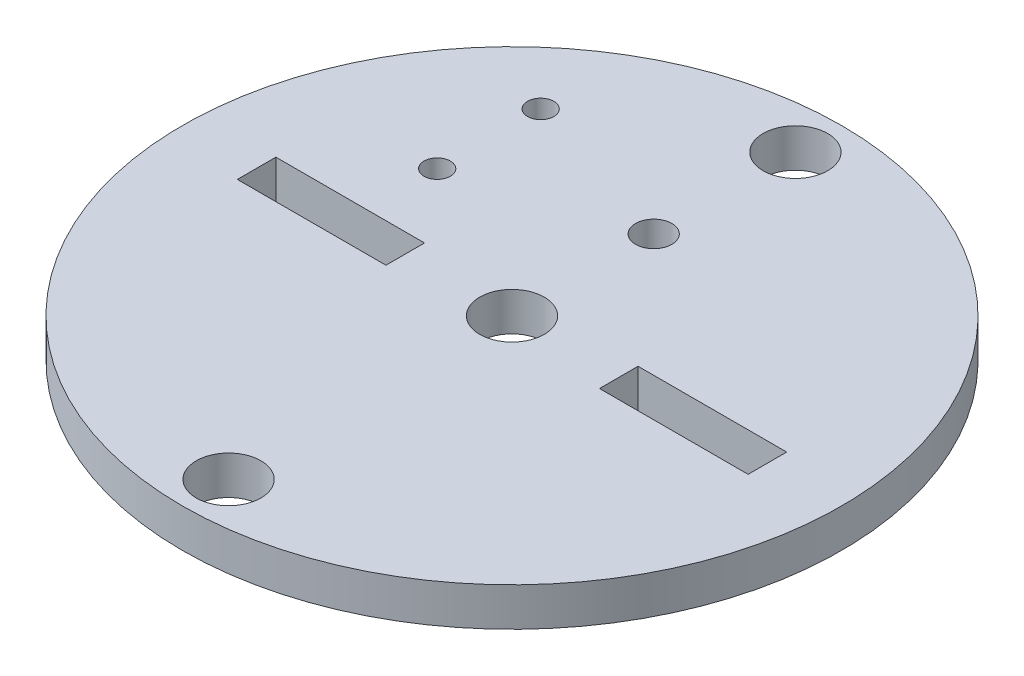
ISO-10303-21;
HEADER;
FILE_DESCRIPTION(('STEP AP214'),'2;1');
FILE_NAME('part.step','',(''),(''),'','','');
FILE_SCHEMA(('AUTOMOTIVE_DESIGN { 1 0 10303 214 1 1 1 1 }'));
ENDSEC;
DATA;
#1=APPLICATION_CONTEXT('core data for automotive mechanical design processes');
#2=APPLICATION_PROTOCOL_DEFINITION('international standard','automotive_design',2000,#1);
#3=PRODUCT_CONTEXT('',#1,'mechanical');
#4=PRODUCT('Part','Part','',(#3));
#5=PRODUCT_RELATED_PRODUCT_CATEGORY('part','',(#4));
#6=PRODUCT_DEFINITION_FORMATION('','',#4);
#7=PRODUCT_DEFINITION_CONTEXT('part definition',#1,'design');
#8=PRODUCT_DEFINITION('design','',#6,#7);
#9=PRODUCT_DEFINITION_SHAPE('','',#8);
#10=(LENGTH_UNIT() NAMED_UNIT(*) SI_UNIT(.MILLI.,.METRE.));
#11=(NAMED_UNIT(*) PLANE_ANGLE_UNIT() SI_UNIT($,.RADIAN.));
#12=(NAMED_UNIT(*) SI_UNIT($,.STERADIAN.) SOLID_ANGLE_UNIT());
#13=UNCERTAINTY_MEASURE_WITH_UNIT(LENGTH_MEASURE(1.E-05),#10,'distance_accuracy_value','');
#14=(GEOMETRIC_REPRESENTATION_CONTEXT(3) GLOBAL_UNCERTAINTY_ASSIGNED_CONTEXT((#13)) GLOBAL_UNIT_ASSIGNED_CONTEXT((#10,
#11,#12)) REPRESENTATION_CONTEXT('',''));
#15=CARTESIAN_POINT('',(0.,0.,0.));
#16=DIRECTION('',(0.,0.,1.));
#17=DIRECTION('',(1.,0.,0.));
#18=AXIS2_PLACEMENT_3D('',#15,#16,#17);
#19=CARTESIAN_POINT('',(0.,2.9718,0.));
#20=DIRECTION('',(0.,-1.,0.));
#21=DIRECTION('',(0.,0.,-1.));
#22=AXIS2_PLACEMENT_3D('',#19,#20,#21);
#23=CYLINDRICAL_SURFACE('',#22,25.4);
#24=CARTESIAN_POINT('',(0.,2.9718,0.));
#25=DIRECTION('',(0.,1.,0.));
#26=DIRECTION('',(0.,0.,1.));
#27=AXIS2_PLACEMENT_3D('',#24,#25,#26);
#28=CIRCLE('',#27,25.4);
#29=CARTESIAN_POINT('',(0.,2.9718,25.4));
#30=VERTEX_POINT('',#29);
#31=EDGE_CURVE('E11',#30,#30,#28,.T.);
#32=ORIENTED_EDGE('',*,*,#31,.F.);
#33=EDGE_LOOP('',(#32));
#34=FACE_BOUND('',#33,.T.);
#35=CARTESIAN_POINT('',(0.,0.,0.));
#36=DIRECTION('',(0.,1.,0.));
#37=DIRECTION('',(0.,0.,1.));
#38=AXIS2_PLACEMENT_3D('',#35,#36,#37);
#39=CIRCLE('',#38,25.4);
#40=CARTESIAN_POINT('',(0.,0.,25.4));
#41=VERTEX_POINT('',#40);
#42=EDGE_CURVE('E43',#41,#41,#39,.T.);
#43=ORIENTED_EDGE('',*,*,#42,.T.);
#44=EDGE_LOOP('',(#43));
#45=FACE_BOUND('',#44,.T.);
#46=ADVANCED_FACE('F40',(#34,#45),#23,.T.);
#47=CARTESIAN_POINT('',(0.,2.9718,0.));
#48=DIRECTION('',(0.,1.,0.));
#49=DIRECTION('',(0.,0.,1.));
#50=AXIS2_PLACEMENT_3D('',#47,#48,#49);
#51=PLANE('',#50);
#52=CARTESIAN_POINT('',(0.,2.9718,-10.922));
#53=DIRECTION('',(0.,1.,0.));
#54=DIRECTION('',(0.,0.,1.));
#55=AXIS2_PLACEMENT_3D('',#52,#53,#54);
#56=CIRCLE('',#55,1.397);
#57=CARTESIAN_POINT('',(0.,2.9718,-9.525));
#58=VERTEX_POINT('',#57);
#59=EDGE_CURVE('E391',#58,#58,#56,.T.);
#60=ORIENTED_EDGE('',*,*,#59,.F.);
#61=EDGE_LOOP('',(#60));
#62=FACE_BOUND('',#61,.T.);
#63=CARTESIAN_POINT('',(-12.7,2.9718,-14.9098));
#64=DIRECTION('',(0.,1.,0.));
#65=DIRECTION('',(0.,0.,1.));
#66=AXIS2_PLACEMENT_3D('',#63,#64,#65);
#67=CIRCLE('',#66,1.016);
#68=CARTESIAN_POINT('',(-12.7,2.9718,-13.8938));
#69=VERTEX_POINT('',#68);
#70=EDGE_CURVE('E396',#69,#69,#67,.T.);
#71=ORIENTED_EDGE('',*,*,#70,.F.);
#72=EDGE_LOOP('',(#71));
#73=FACE_BOUND('',#72,.T.);
#74=CARTESIAN_POINT('',(-12.7,2.9718,-6.9342));
#75=DIRECTION('',(0.,1.,0.));
#76=DIRECTION('',(0.,0.,-1.));
#77=AXIS2_PLACEMENT_3D('',#74,#75,#76);
#78=CIRCLE('',#77,1.016);
#79=CARTESIAN_POINT('',(-12.7,2.9718,-7.9502));
#80=VERTEX_POINT('',#79);
#81=EDGE_CURVE('E131',#80,#80,#78,.T.);
#82=ORIENTED_EDGE('',*,*,#81,.F.);
#83=EDGE_LOOP('',(#82));
#84=FACE_BOUND('',#83,.T.);
#85=DIRECTION('',(0.,0.,-1.));
#86=VECTOR('',#85,1.);
#87=CARTESIAN_POINT('',(19.685,2.9718,-1.4859));
#88=LINE('',#87,#86);
#89=CARTESIAN_POINT('',(19.685,2.9718,1.4859));
#90=VERTEX_POINT('',#89);
#91=CARTESIAN_POINT('',(19.685,2.9718,-1.4859));
#92=VERTEX_POINT('',#91);
#93=EDGE_CURVE('E54',#90,#92,#88,.T.);
#94=ORIENTED_EDGE('',*,*,#93,.F.);
#95=DIRECTION('',(1.,0.,0.));
#96=VECTOR('',#95,1.);
#97=CARTESIAN_POINT('',(8.2296,2.9718,1.4859));
#98=LINE('',#97,#96);
#99=CARTESIAN_POINT('',(8.2296,2.9718,1.4859));
#100=VERTEX_POINT('',#99);
#101=EDGE_CURVE('E125',#100,#90,#98,.T.);
#102=ORIENTED_EDGE('',*,*,#101,.F.);
#103=DIRECTION('',(0.,0.,1.));
#104=VECTOR('',#103,1.);
#105=CARTESIAN_POINT('',(8.2296,2.9718,-1.4859));
#106=LINE('',#105,#104);
#107=CARTESIAN_POINT('',(8.2296,2.9718,-1.4859));
#108=VERTEX_POINT('',#107);
#109=EDGE_CURVE('E128',#108,#100,#106,.T.);
#110=ORIENTED_EDGE('',*,*,#109,.F.);
#111=DIRECTION('',(-1.,0.,0.));
#112=VECTOR('',#111,1.);
#113=CARTESIAN_POINT('',(8.2296,2.9718,-1.4859));
#114=LINE('',#113,#112);
#115=EDGE_CURVE('E137',#92,#108,#114,.T.);
#116=ORIENTED_EDGE('',*,*,#115,.F.);
#117=EDGE_LOOP('',(#94,#102,#110,#116));
#118=FACE_BOUND('',#117,.T.);
#119=DIRECTION('',(0.,0.,-1.));
#120=VECTOR('',#119,1.);
#121=CARTESIAN_POINT('',(-8.2296,2.9718,-1.4859));
#122=LINE('',#121,#120);
#123=CARTESIAN_POINT('',(-8.2296,2.9718,1.4859));
#124=VERTEX_POINT('',#123);
#125=CARTESIAN_POINT('',(-8.2296,2.9718,-1.4859));
#126=VERTEX_POINT('',#125);
#127=EDGE_CURVE('E62',#124,#126,#122,.T.);
#128=ORIENTED_EDGE('',*,*,#127,.F.);
#129=DIRECTION('',(1.,0.,0.));
#130=VECTOR('',#129,1.);
#131=CARTESIAN_POINT('',(-8.2296,2.9718,1.4859));
#132=LINE('',#131,#130);
#133=CARTESIAN_POINT('',(-19.685,2.9718,1.4859));
#134=VERTEX_POINT('',#133);
#135=EDGE_CURVE('E152',#134,#124,#132,.T.);
#136=ORIENTED_EDGE('',*,*,#135,.F.);
#137=DIRECTION('',(0.,0.,1.));
#138=VECTOR('',#137,1.);
#139=CARTESIAN_POINT('',(-19.685,2.9718,-1.4859));
#140=LINE('',#139,#138);
#141=CARTESIAN_POINT('',(-19.685,2.9718,-1.4859));
#142=VERTEX_POINT('',#141);
#143=EDGE_CURVE('E167',#142,#134,#140,.T.);
#144=ORIENTED_EDGE('',*,*,#143,.F.);
#145=DIRECTION('',(-1.,0.,0.));
#146=VECTOR('',#145,1.);
#147=CARTESIAN_POINT('',(-8.2296,2.9718,-1.4859));
#148=LINE('',#147,#146);
#149=EDGE_CURVE('E163',#126,#142,#148,.T.);
#150=ORIENTED_EDGE('',*,*,#149,.F.);
#151=EDGE_LOOP('',(#128,#136,#144,#150));
#152=FACE_BOUND('',#151,.T.);
#153=CARTESIAN_POINT('',(0.,2.9718,0.));
#154=DIRECTION('',(0.,1.,0.));
#155=DIRECTION('',(0.,0.,1.));
#156=AXIS2_PLACEMENT_3D('',#153,#154,#155);
#157=CIRCLE('',#156,2.4892);
#158=CARTESIAN_POINT('',(0.,2.9718,2.4892));
#159=VERTEX_POINT('',#158);
#160=EDGE_CURVE('E144',#159,#159,#157,.T.);
#161=ORIENTED_EDGE('',*,*,#160,.F.);
#162=EDGE_LOOP('',(#161));
#163=FACE_BOUND('',#162,.T.);
#164=CARTESIAN_POINT('',(0.,2.9718,-21.844));
#165=DIRECTION('',(0.,1.,0.));
#166=DIRECTION('',(0.,0.,1.));
#167=AXIS2_PLACEMENT_3D('',#164,#165,#166);
#168=CIRCLE('',#167,2.4892);
#169=CARTESIAN_POINT('',(0.,2.9718,-19.3548));
#170=VERTEX_POINT('',#169);
#171=EDGE_CURVE('E183',#170,#170,#168,.T.);
#172=ORIENTED_EDGE('',*,*,#171,.F.);
#173=EDGE_LOOP('',(#172));
#174=FACE_BOUND('',#173,.T.);
#175=CARTESIAN_POINT('',(0.,2.9718,21.844));
#176=DIRECTION('',(0.,1.,0.));
#177=DIRECTION('',(0.,0.,1.));
#178=AXIS2_PLACEMENT_3D('',#175,#176,#177);
#179=CIRCLE('',#178,2.4892);
#180=CARTESIAN_POINT('',(0.,2.9718,24.3332));
#181=VERTEX_POINT('',#180);
#182=EDGE_CURVE('E189',#181,#181,#179,.T.);
#183=ORIENTED_EDGE('',*,*,#182,.F.);
#184=EDGE_LOOP('',(#183));
#185=FACE_BOUND('',#184,.T.);
#186=ORIENTED_EDGE('',*,*,#31,.T.);
#187=EDGE_LOOP('',(#186));
#188=FACE_BOUND('',#187,.T.);
#189=ADVANCED_FACE('F202',(#62,#73,#84,#118,#152,#163,#174,#185,#188),#51,.T.);
#190=CARTESIAN_POINT('',(0.,0.,0.));
#191=DIRECTION('',(0.,1.,0.));
#192=DIRECTION('',(0.,0.,1.));
#193=AXIS2_PLACEMENT_3D('',#190,#191,#192);
#194=PLANE('',#193);
#195=CARTESIAN_POINT('',(0.,0.,-10.922));
#196=DIRECTION('',(0.,1.,0.));
#197=DIRECTION('',(0.,0.,1.));
#198=AXIS2_PLACEMENT_3D('',#195,#196,#197);
#199=CIRCLE('',#198,1.397);
#200=CARTESIAN_POINT('',(0.,0.,-9.525));
#201=VERTEX_POINT('',#200);
#202=EDGE_CURVE('E164',#201,#201,#199,.T.);
#203=ORIENTED_EDGE('',*,*,#202,.T.);
#204=EDGE_LOOP('',(#203));
#205=FACE_BOUND('',#204,.T.);
#206=CARTESIAN_POINT('',(-12.7,0.,-14.9098));
#207=DIRECTION('',(0.,1.,0.));
#208=DIRECTION('',(0.,0.,1.));
#209=AXIS2_PLACEMENT_3D('',#206,#207,#208);
#210=CIRCLE('',#209,1.016);
#211=CARTESIAN_POINT('',(-12.7,0.,-13.8938));
#212=VERTEX_POINT('',#211);
#213=EDGE_CURVE('E392',#212,#212,#210,.T.);
#214=ORIENTED_EDGE('',*,*,#213,.T.);
#215=EDGE_LOOP('',(#214));
#216=FACE_BOUND('',#215,.T.);
#217=CARTESIAN_POINT('',(-12.7,0.,-6.9342));
#218=DIRECTION('',(0.,1.,0.));
#219=DIRECTION('',(0.,0.,-1.));
#220=AXIS2_PLACEMENT_3D('',#217,#218,#219);
#221=CIRCLE('',#220,1.016);
#222=CARTESIAN_POINT('',(-12.7,0.,-7.9502));
#223=VERTEX_POINT('',#222);
#224=EDGE_CURVE('E400',#223,#223,#221,.T.);
#225=ORIENTED_EDGE('',*,*,#224,.T.);
#226=EDGE_LOOP('',(#225));
#227=FACE_BOUND('',#226,.T.);
#228=DIRECTION('',(1.,0.,0.));
#229=VECTOR('',#228,1.);
#230=CARTESIAN_POINT('',(8.2296,0.,1.4859));
#231=LINE('',#230,#229);
#232=CARTESIAN_POINT('',(8.2296,0.,1.4859));
#233=VERTEX_POINT('',#232);
#234=CARTESIAN_POINT('',(19.685,0.,1.4859));
#235=VERTEX_POINT('',#234);
#236=EDGE_CURVE('E112',#233,#235,#231,.T.);
#237=ORIENTED_EDGE('',*,*,#236,.T.);
#238=DIRECTION('',(0.,0.,-1.));
#239=VECTOR('',#238,1.);
#240=CARTESIAN_POINT('',(19.685,0.,-1.4859));
#241=LINE('',#240,#239);
#242=CARTESIAN_POINT('',(19.685,0.,-1.4859));
#243=VERTEX_POINT('',#242);
#244=EDGE_CURVE('E106',#235,#243,#241,.T.);
#245=ORIENTED_EDGE('',*,*,#244,.T.);
#246=DIRECTION('',(-1.,0.,0.));
#247=VECTOR('',#246,1.);
#248=CARTESIAN_POINT('',(8.2296,0.,-1.4859));
#249=LINE('',#248,#247);
#250=CARTESIAN_POINT('',(8.2296,0.,-1.4859));
#251=VERTEX_POINT('',#250);
#252=EDGE_CURVE('E116',#243,#251,#249,.T.);
#253=ORIENTED_EDGE('',*,*,#252,.T.);
#254=DIRECTION('',(0.,0.,1.));
#255=VECTOR('',#254,1.);
#256=CARTESIAN_POINT('',(8.2296,0.,-1.4859));
#257=LINE('',#256,#255);
#258=EDGE_CURVE('E120',#251,#233,#257,.T.);
#259=ORIENTED_EDGE('',*,*,#258,.T.);
#260=EDGE_LOOP('',(#237,#245,#253,#259));
#261=FACE_BOUND('',#260,.T.);
#262=DIRECTION('',(1.,0.,0.));
#263=VECTOR('',#262,1.);
#264=CARTESIAN_POINT('',(-8.2296,0.,1.4859));
#265=LINE('',#264,#263);
#266=CARTESIAN_POINT('',(-19.685,0.,1.4859));
#267=VERTEX_POINT('',#266);
#268=CARTESIAN_POINT('',(-8.2296,0.,1.4859));
#269=VERTEX_POINT('',#268);
#270=EDGE_CURVE('E158',#267,#269,#265,.T.);
#271=ORIENTED_EDGE('',*,*,#270,.T.);
#272=DIRECTION('',(0.,0.,-1.));
#273=VECTOR('',#272,1.);
#274=CARTESIAN_POINT('',(-8.2296,0.,-1.4859));
#275=LINE('',#274,#273);
#276=CARTESIAN_POINT('',(-8.2296,0.,-1.4859));
#277=VERTEX_POINT('',#276);
#278=EDGE_CURVE('E148',#269,#277,#275,.T.);
#279=ORIENTED_EDGE('',*,*,#278,.T.);
#280=DIRECTION('',(-1.,0.,0.));
#281=VECTOR('',#280,1.);
#282=CARTESIAN_POINT('',(-8.2296,0.,-1.4859));
#283=LINE('',#282,#281);
#284=CARTESIAN_POINT('',(-19.685,0.,-1.4859));
#285=VERTEX_POINT('',#284);
#286=EDGE_CURVE('E151',#277,#285,#283,.T.);
#287=ORIENTED_EDGE('',*,*,#286,.T.);
#288=DIRECTION('',(0.,0.,1.));
#289=VECTOR('',#288,1.);
#290=CARTESIAN_POINT('',(-19.685,0.,-1.4859));
#291=LINE('',#290,#289);
#292=EDGE_CURVE('E155',#285,#267,#291,.T.);
#293=ORIENTED_EDGE('',*,*,#292,.T.);
#294=EDGE_LOOP('',(#271,#279,#287,#293));
#295=FACE_BOUND('',#294,.T.);
#296=CARTESIAN_POINT('',(0.,0.,0.));
#297=DIRECTION('',(0.,1.,0.));
#298=DIRECTION('',(0.,0.,1.));
#299=AXIS2_PLACEMENT_3D('',#296,#297,#298);
#300=CIRCLE('',#299,2.4892);
#301=CARTESIAN_POINT('',(0.,0.,2.4892));
#302=VERTEX_POINT('',#301);
#303=EDGE_CURVE('E180',#302,#302,#300,.T.);
#304=ORIENTED_EDGE('',*,*,#303,.T.);
#305=EDGE_LOOP('',(#304));
#306=FACE_BOUND('',#305,.T.);
#307=CARTESIAN_POINT('',(0.,0.,-21.844));
#308=DIRECTION('',(0.,1.,0.));
#309=DIRECTION('',(0.,0.,1.));
#310=AXIS2_PLACEMENT_3D('',#307,#308,#309);
#311=CIRCLE('',#310,2.4892);
#312=CARTESIAN_POINT('',(0.,0.,-19.3548));
#313=VERTEX_POINT('',#312);
#314=EDGE_CURVE('E186',#313,#313,#311,.T.);
#315=ORIENTED_EDGE('',*,*,#314,.T.);
#316=EDGE_LOOP('',(#315));
#317=FACE_BOUND('',#316,.T.);
#318=CARTESIAN_POINT('',(0.,0.,21.844));
#319=DIRECTION('',(0.,1.,0.));
#320=DIRECTION('',(0.,0.,1.));
#321=AXIS2_PLACEMENT_3D('',#318,#319,#320);
#322=CIRCLE('',#321,2.4892);
#323=CARTESIAN_POINT('',(0.,0.,24.3332));
#324=VERTEX_POINT('',#323);
#325=EDGE_CURVE('E192',#324,#324,#322,.T.);
#326=ORIENTED_EDGE('',*,*,#325,.T.);
#327=EDGE_LOOP('',(#326));
#328=FACE_BOUND('',#327,.T.);
#329=ORIENTED_EDGE('',*,*,#42,.F.);
#330=EDGE_LOOP('',(#329));
#331=FACE_BOUND('',#330,.T.);
#332=ADVANCED_FACE('F122',(#205,#216,#227,#261,#295,#306,#317,#328,#331),#194,.F.);
#333=CARTESIAN_POINT('',(0.,2.9718,21.844));
#334=DIRECTION('',(0.,1.,0.));
#335=DIRECTION('',(0.,0.,1.));
#336=AXIS2_PLACEMENT_3D('',#333,#334,#335);
#337=CYLINDRICAL_SURFACE('',#336,2.4892);
#338=ORIENTED_EDGE('',*,*,#325,.F.);
#339=EDGE_LOOP('',(#338));
#340=FACE_BOUND('',#339,.T.);
#341=ORIENTED_EDGE('',*,*,#182,.T.);
#342=EDGE_LOOP('',(#341));
#343=FACE_BOUND('',#342,.T.);
#344=ADVANCED_FACE('F201',(#340,#343),#337,.F.);
#345=CARTESIAN_POINT('',(0.,2.9718,-21.844));
#346=DIRECTION('',(0.,1.,0.));
#347=DIRECTION('',(0.,0.,1.));
#348=AXIS2_PLACEMENT_3D('',#345,#346,#347);
#349=CYLINDRICAL_SURFACE('',#348,2.4892);
#350=ORIENTED_EDGE('',*,*,#314,.F.);
#351=EDGE_LOOP('',(#350));
#352=FACE_BOUND('',#351,.T.);
#353=ORIENTED_EDGE('',*,*,#171,.T.);
#354=EDGE_LOOP('',(#353));
#355=FACE_BOUND('',#354,.T.);
#356=ADVANCED_FACE('F208',(#352,#355),#349,.F.);
#357=CARTESIAN_POINT('',(0.,2.9718,0.));
#358=DIRECTION('',(0.,1.,0.));
#359=DIRECTION('',(0.,0.,1.));
#360=AXIS2_PLACEMENT_3D('',#357,#358,#359);
#361=CYLINDRICAL_SURFACE('',#360,2.4892);
#362=ORIENTED_EDGE('',*,*,#303,.F.);
#363=EDGE_LOOP('',(#362));
#364=FACE_BOUND('',#363,.T.);
#365=ORIENTED_EDGE('',*,*,#160,.T.);
#366=EDGE_LOOP('',(#365));
#367=FACE_BOUND('',#366,.T.);
#368=ADVANCED_FACE('F299',(#364,#367),#361,.F.);
#369=CARTESIAN_POINT('',(-8.2296,0.,-1.4859));
#370=DIRECTION('',(1.,0.,0.));
#371=DIRECTION('',(0.,0.,-1.));
#372=AXIS2_PLACEMENT_3D('',#369,#370,#371);
#373=PLANE('',#372);
#374=ORIENTED_EDGE('',*,*,#127,.T.);
#375=DIRECTION('',(0.,1.,0.));
#376=VECTOR('',#375,1.);
#377=CARTESIAN_POINT('',(-8.2296,0.,-1.4859));
#378=LINE('',#377,#376);
#379=EDGE_CURVE('E161',#277,#126,#378,.T.);
#380=ORIENTED_EDGE('',*,*,#379,.F.);
#381=ORIENTED_EDGE('',*,*,#278,.F.);
#382=DIRECTION('',(0.,1.,0.));
#383=VECTOR('',#382,1.);
#384=CARTESIAN_POINT('',(-8.2296,0.,1.4859));
#385=LINE('',#384,#383);
#386=EDGE_CURVE('E138',#269,#124,#385,.T.);
#387=ORIENTED_EDGE('',*,*,#386,.T.);
#388=EDGE_LOOP('',(#374,#380,#381,#387));
#389=FACE_BOUND('',#388,.T.);
#390=ADVANCED_FACE('F289',(#389),#373,.F.);
#391=CARTESIAN_POINT('',(-8.2296,0.,1.4859));
#392=DIRECTION('',(0.,0.,1.));
#393=DIRECTION('',(1.,0.,0.));
#394=AXIS2_PLACEMENT_3D('',#391,#392,#393);
#395=PLANE('',#394);
#396=ORIENTED_EDGE('',*,*,#135,.T.);
#397=ORIENTED_EDGE('',*,*,#386,.F.);
#398=ORIENTED_EDGE('',*,*,#270,.F.);
#399=DIRECTION('',(0.,1.,0.));
#400=VECTOR('',#399,1.);
#401=CARTESIAN_POINT('',(-19.685,0.,1.4859));
#402=LINE('',#401,#400);
#403=EDGE_CURVE('E173',#267,#134,#402,.T.);
#404=ORIENTED_EDGE('',*,*,#403,.T.);
#405=EDGE_LOOP('',(#396,#397,#398,#404));
#406=FACE_BOUND('',#405,.T.);
#407=ADVANCED_FACE('F285',(#406),#395,.F.);
#408=CARTESIAN_POINT('',(-19.685,0.,-1.4859));
#409=DIRECTION('',(-1.,0.,0.));
#410=DIRECTION('',(0.,0.,1.));
#411=AXIS2_PLACEMENT_3D('',#408,#409,#410);
#412=PLANE('',#411);
#413=ORIENTED_EDGE('',*,*,#143,.T.);
#414=ORIENTED_EDGE('',*,*,#403,.F.);
#415=ORIENTED_EDGE('',*,*,#292,.F.);
#416=DIRECTION('',(0.,1.,0.));
#417=VECTOR('',#416,1.);
#418=CARTESIAN_POINT('',(-19.685,0.,-1.4859));
#419=LINE('',#418,#417);
#420=EDGE_CURVE('E175',#285,#142,#419,.T.);
#421=ORIENTED_EDGE('',*,*,#420,.T.);
#422=EDGE_LOOP('',(#413,#414,#415,#421));
#423=FACE_BOUND('',#422,.T.);
#424=ADVANCED_FACE('F288',(#423),#412,.F.);
#425=CARTESIAN_POINT('',(-8.2296,0.,-1.4859));
#426=DIRECTION('',(0.,0.,-1.));
#427=DIRECTION('',(-1.,0.,0.));
#428=AXIS2_PLACEMENT_3D('',#425,#426,#427);
#429=PLANE('',#428);
#430=ORIENTED_EDGE('',*,*,#149,.T.);
#431=ORIENTED_EDGE('',*,*,#420,.F.);
#432=ORIENTED_EDGE('',*,*,#286,.F.);
#433=ORIENTED_EDGE('',*,*,#379,.T.);
#434=EDGE_LOOP('',(#430,#431,#432,#433));
#435=FACE_BOUND('',#434,.T.);
#436=ADVANCED_FACE('F284',(#435),#429,.F.);
#437=CARTESIAN_POINT('',(19.685,0.,-1.4859));
#438=DIRECTION('',(1.,0.,0.));
#439=DIRECTION('',(0.,0.,-1.));
#440=AXIS2_PLACEMENT_3D('',#437,#438,#439);
#441=PLANE('',#440);
#442=ORIENTED_EDGE('',*,*,#93,.T.);
#443=DIRECTION('',(0.,1.,0.));
#444=VECTOR('',#443,1.);
#445=CARTESIAN_POINT('',(19.685,0.,-1.4859));
#446=LINE('',#445,#444);
#447=EDGE_CURVE('E102',#243,#92,#446,.T.);
#448=ORIENTED_EDGE('',*,*,#447,.F.);
#449=ORIENTED_EDGE('',*,*,#244,.F.);
#450=DIRECTION('',(0.,1.,0.));
#451=VECTOR('',#450,1.);
#452=CARTESIAN_POINT('',(19.685,0.,1.4859));
#453=LINE('',#452,#451);
#454=EDGE_CURVE('E142',#235,#90,#453,.T.);
#455=ORIENTED_EDGE('',*,*,#454,.T.);
#456=EDGE_LOOP('',(#442,#448,#449,#455));
#457=FACE_BOUND('',#456,.T.);
#458=ADVANCED_FACE('F104',(#457),#441,.F.);
#459=CARTESIAN_POINT('',(8.2296,0.,1.4859));
#460=DIRECTION('',(0.,0.,1.));
#461=DIRECTION('',(1.,0.,0.));
#462=AXIS2_PLACEMENT_3D('',#459,#460,#461);
#463=PLANE('',#462);
#464=ORIENTED_EDGE('',*,*,#101,.T.);
#465=ORIENTED_EDGE('',*,*,#454,.F.);
#466=ORIENTED_EDGE('',*,*,#236,.F.);
#467=DIRECTION('',(0.,1.,0.));
#468=VECTOR('',#467,1.);
#469=CARTESIAN_POINT('',(8.2296,0.,1.4859));
#470=LINE('',#469,#468);
#471=EDGE_CURVE('E145',#233,#100,#470,.T.);
#472=ORIENTED_EDGE('',*,*,#471,.T.);
#473=EDGE_LOOP('',(#464,#465,#466,#472));
#474=FACE_BOUND('',#473,.T.);
#475=ADVANCED_FACE('F273',(#474),#463,.F.);
#476=CARTESIAN_POINT('',(8.2296,0.,-1.4859));
#477=DIRECTION('',(-1.,0.,0.));
#478=DIRECTION('',(0.,0.,1.));
#479=AXIS2_PLACEMENT_3D('',#476,#477,#478);
#480=PLANE('',#479);
#481=ORIENTED_EDGE('',*,*,#109,.T.);
#482=ORIENTED_EDGE('',*,*,#471,.F.);
#483=ORIENTED_EDGE('',*,*,#258,.F.);
#484=DIRECTION('',(0.,1.,0.));
#485=VECTOR('',#484,1.);
#486=CARTESIAN_POINT('',(8.2296,0.,-1.4859));
#487=LINE('',#486,#485);
#488=EDGE_CURVE('E111',#251,#108,#487,.T.);
#489=ORIENTED_EDGE('',*,*,#488,.T.);
#490=EDGE_LOOP('',(#481,#482,#483,#489));
#491=FACE_BOUND('',#490,.T.);
#492=ADVANCED_FACE('F276',(#491),#480,.F.);
#493=CARTESIAN_POINT('',(8.2296,0.,-1.4859));
#494=DIRECTION('',(0.,0.,-1.));
#495=DIRECTION('',(-1.,0.,0.));
#496=AXIS2_PLACEMENT_3D('',#493,#494,#495);
#497=PLANE('',#496);
#498=ORIENTED_EDGE('',*,*,#115,.T.);
#499=ORIENTED_EDGE('',*,*,#488,.F.);
#500=ORIENTED_EDGE('',*,*,#252,.F.);
#501=ORIENTED_EDGE('',*,*,#447,.T.);
#502=EDGE_LOOP('',(#498,#499,#500,#501));
#503=FACE_BOUND('',#502,.T.);
#504=ADVANCED_FACE('F117',(#503),#497,.F.);
#505=CARTESIAN_POINT('',(-12.7,0.,-6.9342));
#506=DIRECTION('',(0.,1.,0.));
#507=DIRECTION('',(0.,0.,1.));
#508=AXIS2_PLACEMENT_3D('',#505,#506,#507);
#509=CYLINDRICAL_SURFACE('',#508,1.016);
#510=ORIENTED_EDGE('',*,*,#224,.F.);
#511=EDGE_LOOP('',(#510));
#512=FACE_BOUND('',#511,.T.);
#513=ORIENTED_EDGE('',*,*,#81,.T.);
#514=EDGE_LOOP('',(#513));
#515=FACE_BOUND('',#514,.T.);
#516=ADVANCED_FACE('F241',(#512,#515),#509,.F.);
#517=CARTESIAN_POINT('',(-12.7,0.,-14.9098));
#518=DIRECTION('',(0.,1.,0.));
#519=DIRECTION('',(0.,0.,1.));
#520=AXIS2_PLACEMENT_3D('',#517,#518,#519);
#521=CYLINDRICAL_SURFACE('',#520,1.016);
#522=ORIENTED_EDGE('',*,*,#213,.F.);
#523=EDGE_LOOP('',(#522));
#524=FACE_BOUND('',#523,.T.);
#525=ORIENTED_EDGE('',*,*,#70,.T.);
#526=EDGE_LOOP('',(#525));
#527=FACE_BOUND('',#526,.T.);
#528=ADVANCED_FACE('F246',(#524,#527),#521,.F.);
#529=CARTESIAN_POINT('',(0.,0.,-10.922));
#530=DIRECTION('',(0.,1.,0.));
#531=DIRECTION('',(0.,0.,1.));
#532=AXIS2_PLACEMENT_3D('',#529,#530,#531);
#533=CYLINDRICAL_SURFACE('',#532,1.397);
#534=ORIENTED_EDGE('',*,*,#202,.F.);
#535=EDGE_LOOP('',(#534));
#536=FACE_BOUND('',#535,.T.);
#537=ORIENTED_EDGE('',*,*,#59,.T.);
#538=EDGE_LOOP('',(#537));
#539=FACE_BOUND('',#538,.T.);
#540=ADVANCED_FACE('F256',(#536,#539),#533,.F.);
#541=CLOSED_SHELL('',(#46,#189,#332,#344,#356,#368,#390,#407,#424,#436,#458,#475,#492,#504,#516,
#528,#540));
#542=MANIFOLD_SOLID_BREP('B2',#541);
#543=ADVANCED_BREP_SHAPE_REPRESENTATION('',(#18,#542),#14);
#544=SHAPE_DEFINITION_REPRESENTATION(#9,#543);
ENDSEC;
END-ISO-10303-21;
